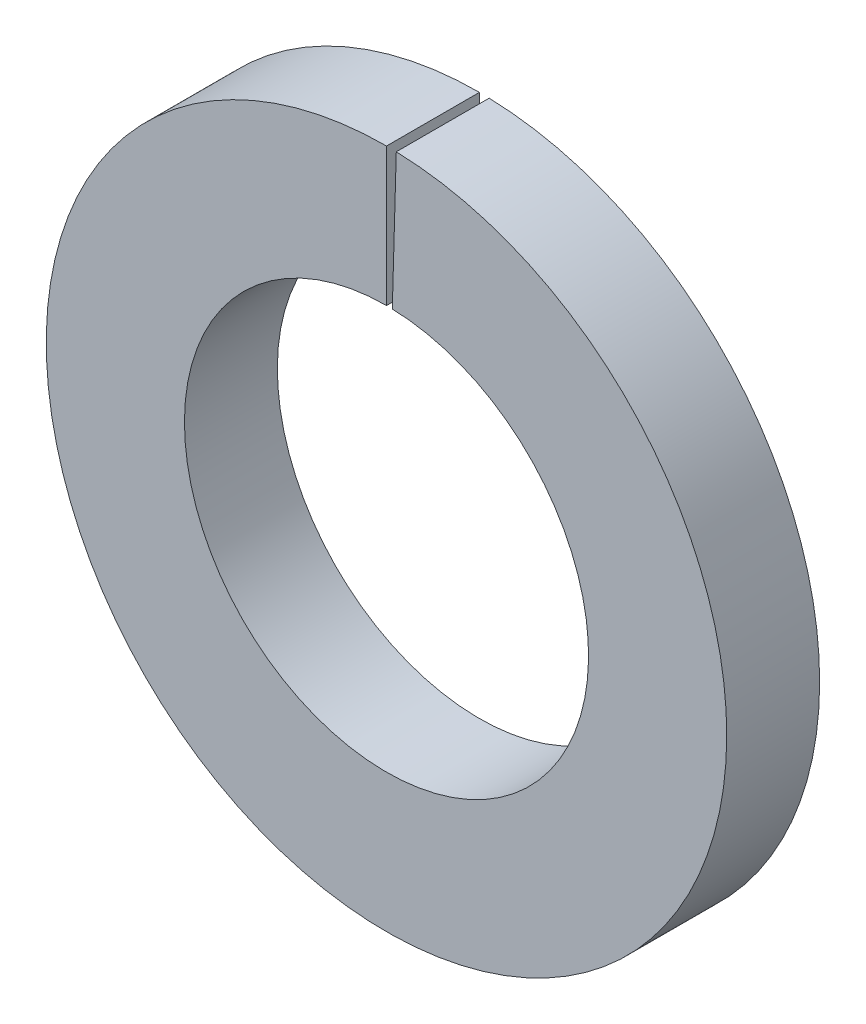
ISO-10303-21;
HEADER;
FILE_DESCRIPTION(('STEP AP214'),'2;1');
FILE_NAME('part.step','',(''),(''),'','','');
FILE_SCHEMA(('AUTOMOTIVE_DESIGN { 1 0 10303 214 1 1 1 1 }'));
ENDSEC;
DATA;
#1=APPLICATION_CONTEXT('core data for automotive mechanical design processes');
#2=APPLICATION_PROTOCOL_DEFINITION('international standard','automotive_design',2000,#1);
#3=PRODUCT_CONTEXT('',#1,'mechanical');
#4=PRODUCT('Part','Part','',(#3));
#5=PRODUCT_RELATED_PRODUCT_CATEGORY('part','',(#4));
#6=PRODUCT_DEFINITION_FORMATION('','',#4);
#7=PRODUCT_DEFINITION_CONTEXT('part definition',#1,'design');
#8=PRODUCT_DEFINITION('design','',#6,#7);
#9=PRODUCT_DEFINITION_SHAPE('','',#8);
#10=(LENGTH_UNIT() NAMED_UNIT(*) SI_UNIT(.MILLI.,.METRE.));
#11=(NAMED_UNIT(*) PLANE_ANGLE_UNIT() SI_UNIT($,.RADIAN.));
#12=(NAMED_UNIT(*) SI_UNIT($,.STERADIAN.) SOLID_ANGLE_UNIT());
#13=UNCERTAINTY_MEASURE_WITH_UNIT(LENGTH_MEASURE(1.E-05),#10,'distance_accuracy_value','');
#14=(GEOMETRIC_REPRESENTATION_CONTEXT(3) GLOBAL_UNCERTAINTY_ASSIGNED_CONTEXT((#13)) GLOBAL_UNIT_ASSIGNED_CONTEXT((#10,
#11,#12)) REPRESENTATION_CONTEXT('',''));
#15=CARTESIAN_POINT('',(0.,0.,0.));
#16=DIRECTION('',(0.,0.,1.));
#17=DIRECTION('',(1.,0.,0.));
#18=AXIS2_PLACEMENT_3D('',#15,#16,#17);
#19=CARTESIAN_POINT('',(-8.88178419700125E-13,1.04083408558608E-13,1.01599999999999));
#20=DIRECTION('',(0.,0.,1.));
#21=DIRECTION('',(1.00000000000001,0.,0.));
#22=AXIS2_PLACEMENT_3D('',#19,#20,#21);
#23=PLANE('',#22);
#24=CARTESIAN_POINT('',(-8.88178419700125E-13,1.04083408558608E-13,1.01599999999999));
#25=DIRECTION('',(0.,0.,1.));
#26=DIRECTION('',(1.00000000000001,0.,0.));
#27=AXIS2_PLACEMENT_3D('',#24,#25,#26);
#28=CIRCLE('',#27,3.7211);
#29=CARTESIAN_POINT('',(-2.66453525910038E-12,3.72110000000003,1.016));
#30=VERTEX_POINT('',#29);
#31=CARTESIAN_POINT('',(0.106917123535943,3.7195636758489,1.01599999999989));
#32=VERTEX_POINT('',#31);
#33=EDGE_CURVE('E11',#30,#32,#28,.T.);
#34=ORIENTED_EDGE('',*,*,#33,.T.);
#35=DIRECTION('',(0.0287326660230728,0.999587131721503,0.));
#36=VECTOR('',#35,1.);
#37=CARTESIAN_POINT('',(0.0634934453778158,2.20888764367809,1.01600000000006));
#38=LINE('',#37,#36);
#39=CARTESIAN_POINT('',(0.0634934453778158,2.20888764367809,1.01600000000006));
#40=VERTEX_POINT('',#39);
#41=EDGE_CURVE('E72',#40,#32,#38,.T.);
#42=ORIENTED_EDGE('',*,*,#41,.F.);
#43=CARTESIAN_POINT('',(-8.88178419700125E-13,1.04083408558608E-13,1.01599999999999));
#44=DIRECTION('',(0.,0.,1.));
#45=DIRECTION('',(1.00000000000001,0.,0.));
#46=AXIS2_PLACEMENT_3D('',#43,#44,#45);
#47=CIRCLE('',#46,2.2098);
#48=CARTESIAN_POINT('',(-1.77635683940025E-12,2.20980000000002,1.01599999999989));
#49=VERTEX_POINT('',#48);
#50=EDGE_CURVE('E89',#49,#40,#47,.T.);
#51=ORIENTED_EDGE('',*,*,#50,.F.);
#52=DIRECTION('',(0.,1.00000000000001,0.));
#53=VECTOR('',#52,1.);
#54=CARTESIAN_POINT('',(-1.77635683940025E-12,2.20980000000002,1.01599999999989));
#55=LINE('',#54,#53);
#56=EDGE_CURVE('E53',#49,#30,#55,.T.);
#57=ORIENTED_EDGE('',*,*,#56,.T.);
#58=EDGE_LOOP('',(#34,#42,#51,#57));
#59=FACE_BOUND('',#58,.T.);
#60=ADVANCED_FACE('F30',(#59),#23,.T.);
#61=CARTESIAN_POINT('',(-8.88178419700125E-13,0.,0.));
#62=DIRECTION('',(0.,0.,1.));
#63=DIRECTION('',(1.00000000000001,0.,0.));
#64=AXIS2_PLACEMENT_3D('',#61,#62,#63);
#65=PLANE('',#64);
#66=DIRECTION('',(0.0287326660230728,0.999587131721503,0.));
#67=VECTOR('',#66,1.);
#68=CARTESIAN_POINT('',(0.0634934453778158,2.20888764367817,-7.35522753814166E-13));
#69=LINE('',#68,#67);
#70=CARTESIAN_POINT('',(0.0634934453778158,2.20888764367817,-7.35522753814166E-13));
#71=VERTEX_POINT('',#70);
#72=CARTESIAN_POINT('',(0.106917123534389,3.71956367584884,0.));
#73=VERTEX_POINT('',#72);
#74=EDGE_CURVE('E45',#71,#73,#69,.T.);
#75=ORIENTED_EDGE('',*,*,#74,.T.);
#76=CARTESIAN_POINT('',(-8.88178419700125E-13,0.,0.));
#77=DIRECTION('',(0.,0.,1.));
#78=DIRECTION('',(1.00000000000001,0.,0.));
#79=AXIS2_PLACEMENT_3D('',#76,#77,#78);
#80=CIRCLE('',#79,3.7211);
#81=CARTESIAN_POINT('',(-2.66453525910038E-12,3.72110000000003,-7.91033905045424E-13));
#82=VERTEX_POINT('',#81);
#83=EDGE_CURVE('E38',#82,#73,#80,.T.);
#84=ORIENTED_EDGE('',*,*,#83,.F.);
#85=DIRECTION('',(0.,1.00000000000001,0.));
#86=VECTOR('',#85,1.);
#87=CARTESIAN_POINT('',(-1.77635683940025E-12,2.20979999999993,0.));
#88=LINE('',#87,#86);
#89=CARTESIAN_POINT('',(-1.77635683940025E-12,2.20979999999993,0.));
#90=VERTEX_POINT('',#89);
#91=EDGE_CURVE('E86',#90,#82,#88,.T.);
#92=ORIENTED_EDGE('',*,*,#91,.F.);
#93=CARTESIAN_POINT('',(-8.88178419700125E-13,0.,0.));
#94=DIRECTION('',(0.,0.,1.));
#95=DIRECTION('',(1.00000000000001,0.,0.));
#96=AXIS2_PLACEMENT_3D('',#93,#94,#95);
#97=CIRCLE('',#96,2.2098);
#98=EDGE_CURVE('E85',#90,#71,#97,.T.);
#99=ORIENTED_EDGE('',*,*,#98,.T.);
#100=EDGE_LOOP('',(#75,#84,#92,#99));
#101=FACE_BOUND('',#100,.T.);
#102=ADVANCED_FACE('F82',(#101),#65,.F.);
#103=CARTESIAN_POINT('',(-8.88178419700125E-13,1.04083408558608E-13,1.01599999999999));
#104=DIRECTION('',(0.,0.,-1.));
#105=DIRECTION('',(-1.00000000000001,0.,0.));
#106=AXIS2_PLACEMENT_3D('',#103,#104,#105);
#107=CYLINDRICAL_SURFACE('',#106,3.7211);
#108=DIRECTION('',(0.,0.,-1.));
#109=VECTOR('',#108,1.);
#110=CARTESIAN_POINT('',(0.106917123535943,3.7195636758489,1.01599999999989));
#111=LINE('',#110,#109);
#112=EDGE_CURVE('E69',#32,#73,#111,.T.);
#113=ORIENTED_EDGE('',*,*,#112,.F.);
#114=ORIENTED_EDGE('',*,*,#33,.F.);
#115=DIRECTION('',(0.,0.,-1.));
#116=VECTOR('',#115,1.);
#117=CARTESIAN_POINT('',(-2.66453525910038E-12,3.72110000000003,1.016));
#118=LINE('',#117,#116);
#119=EDGE_CURVE('E77',#30,#82,#118,.T.);
#120=ORIENTED_EDGE('',*,*,#119,.T.);
#121=ORIENTED_EDGE('',*,*,#83,.T.);
#122=EDGE_LOOP('',(#113,#114,#120,#121));
#123=FACE_BOUND('',#122,.T.);
#124=ADVANCED_FACE('F32',(#123),#107,.T.);
#125=CARTESIAN_POINT('',(-8.88178419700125E-13,1.04083408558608E-13,1.01599999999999));
#126=DIRECTION('',(0.,0.,-1.));
#127=DIRECTION('',(-1.00000000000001,0.,0.));
#128=AXIS2_PLACEMENT_3D('',#125,#126,#127);
#129=CYLINDRICAL_SURFACE('',#128,2.2098);
#130=ORIENTED_EDGE('',*,*,#50,.T.);
#131=DIRECTION('',(0.,0.,-1.));
#132=VECTOR('',#131,1.);
#133=CARTESIAN_POINT('',(0.0634934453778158,2.20888764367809,1.01600000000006));
#134=LINE('',#133,#132);
#135=EDGE_CURVE('E76',#40,#71,#134,.T.);
#136=ORIENTED_EDGE('',*,*,#135,.T.);
#137=ORIENTED_EDGE('',*,*,#98,.F.);
#138=DIRECTION('',(0.,0.,-1.));
#139=VECTOR('',#138,1.);
#140=CARTESIAN_POINT('',(-1.77635683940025E-12,2.20980000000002,1.01599999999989));
#141=LINE('',#140,#139);
#142=EDGE_CURVE('E96',#49,#90,#141,.T.);
#143=ORIENTED_EDGE('',*,*,#142,.F.);
#144=EDGE_LOOP('',(#130,#136,#137,#143));
#145=FACE_BOUND('',#144,.T.);
#146=ADVANCED_FACE('F102',(#145),#129,.F.);
#147=CARTESIAN_POINT('',(-1.77635683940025E-12,2.20980000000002,1.01599999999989));
#148=DIRECTION('',(-1.00000000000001,0.,0.));
#149=DIRECTION('',(0.,0.,1.));
#150=AXIS2_PLACEMENT_3D('',#147,#148,#149);
#151=PLANE('',#150);
#152=ORIENTED_EDGE('',*,*,#91,.T.);
#153=ORIENTED_EDGE('',*,*,#119,.F.);
#154=ORIENTED_EDGE('',*,*,#56,.F.);
#155=ORIENTED_EDGE('',*,*,#142,.T.);
#156=EDGE_LOOP('',(#152,#153,#154,#155));
#157=FACE_BOUND('',#156,.T.);
#158=ADVANCED_FACE('F100',(#157),#151,.F.);
#159=CARTESIAN_POINT('',(0.0634934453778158,2.20888764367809,1.01600000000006));
#160=DIRECTION('',(-0.999587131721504,0.0287326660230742,0.));
#161=DIRECTION('',(-0.0287326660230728,-0.999587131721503,0.));
#162=AXIS2_PLACEMENT_3D('',#159,#160,#161);
#163=PLANE('',#162);
#164=ORIENTED_EDGE('',*,*,#74,.F.);
#165=ORIENTED_EDGE('',*,*,#135,.F.);
#166=ORIENTED_EDGE('',*,*,#41,.T.);
#167=ORIENTED_EDGE('',*,*,#112,.T.);
#168=EDGE_LOOP('',(#164,#165,#166,#167));
#169=FACE_BOUND('',#168,.T.);
#170=ADVANCED_FACE('F70',(#169),#163,.T.);
#171=CLOSED_SHELL('',(#60,#102,#124,#146,#158,#170));
#172=MANIFOLD_SOLID_BREP('B2',#171);
#173=ADVANCED_BREP_SHAPE_REPRESENTATION('',(#18,#172),#14);
#174=SHAPE_DEFINITION_REPRESENTATION(#9,#173);
ENDSEC;
END-ISO-10303-21;
